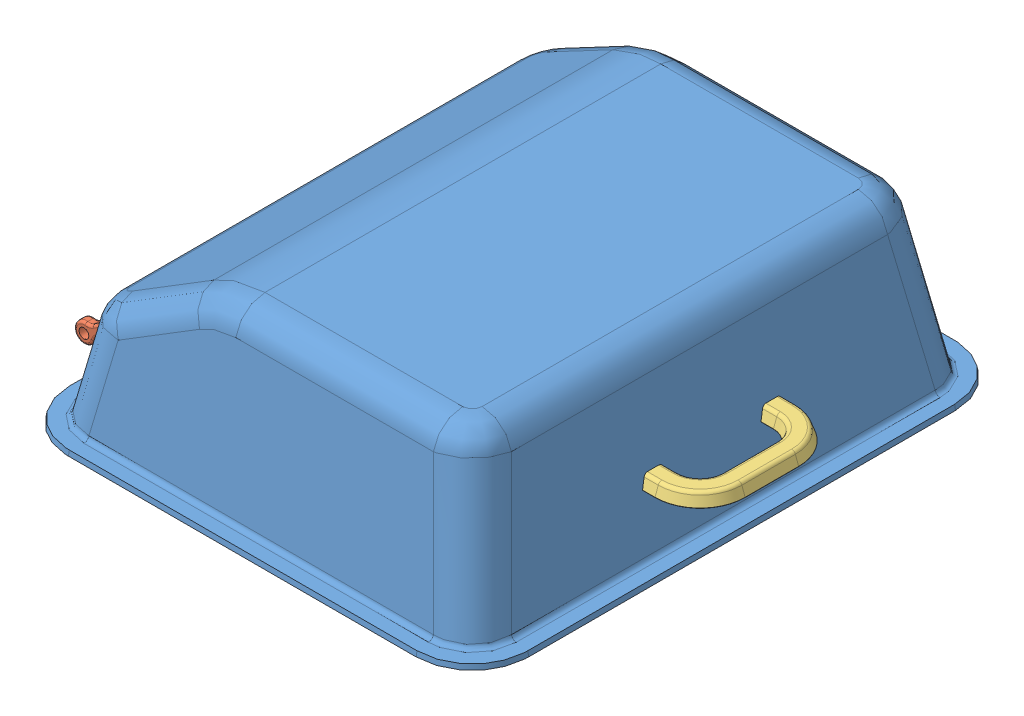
SolidWorks assembly Upper_Cover_&.SLDASM, configuration Default (file format 12000). Lengths in mm.
Overall size (695.3 228.6 691.95).
4 component instances, 3 part files, 8 mates.
Components (placement in the parent):
- Rebuilt_Top_Cover_&-1: Rebuilt_Top_Cover_&.SLDPRT [Default] at origin size (590.35 215.9 691.95)
- hinge_female_&-1: hinge_female_&.sldprt [Default] at (-273.05 0 -193.675) size (102.13 88.85 50.98)
- hinge_female_&-2: hinge_female_&.sldprt [Default] at (-272.9691 0.4588 187.325) size (102.13 88.85 50.98)
- handle_front_mount_&-1: handle_front_mount_&.SLDPRT [Default] at (256.9072 76.2 0) size (76.44 15.35 184.13)
Mates (geometry in assembly coordinates):
- Distance2: distance = 200.025 mm aligned: plane of hinge_female_&-2 through (-349.1691 0.4588 200.025) normal (0 0 1); plane of assembly through (0 0 0) normal (0 0 1)
- Coincident1: coincident anti-aligned: plane of Rebuilt_Top_Cover_&-1 through (234.981 215.9 323.85) normal (0.984808 0.173648 0); plane of handle_front_mount_&-1 through (259.5323 76.6629 0) normal (-0.984808 -0.173648 0)
- Concentric1: concentric aligned: cylinder of Rebuilt_Top_Cover_&-1 through (316.3881 95.6063 75.9772) axis (-0.984808 -0.173648 0) radius 1.3891; cylinder of handle_front_mount_&-1 through (258.0072 85.3122 75.9772) axis (-0.984808 -0.173648 0) radius 1.3891
- Concentric2: concentric aligned: cylinder of Rebuilt_Top_Cover_&-1 through (316.3881 95.6063 -75.9772) axis (-0.984808 -0.173648 0) radius 1.3891; cylinder of handle_front_mount_&-1 through (258.0072 85.3122 -75.9772) axis (-0.984808 -0.173648 0) radius 1.3891
- Concentric3: concentric aligned: cylinder of Rebuilt_Top_Cover_&-1 through (284.1087 -62.7783 -168.275) axis (-0.984808 0.173648 0) radius 3.175; cylinder of hinge_female_&-1 through (-251.9805 31.7487 -168.275) axis (-0.984808 0.173648 0) radius 3.175
- Coincident2: coincident anti-aligned: plane of Rebuilt_Top_Cover_&-1 through (-273.05 0 323.85) normal (-0.984808 0.173648 0); plane of hinge_female_&-1 through (-259.818 75.0424 -142.875) normal (0.984808 -0.173648 0)
- Concentric4: concentric aligned: cylinder of Rebuilt_Top_Cover_&-1 through (289.622 -31.5107 -168.275) axis (-0.984808 0.173648 0) radius 3.175; cylinder of hinge_female_&-1 through (-246.4672 63.0163 -168.275) axis (-0.984808 0.173648 0) radius 3.175
- Coincident3: coincident anti-aligned: plane of Rebuilt_Top_Cover_&-1 through (-273.05 0 323.85) normal (-0.984808 0.173648 0); plane of hinge_female_&-2 through (-259.7371 75.5012 238.125) normal (0.984808 -0.173648 0)
